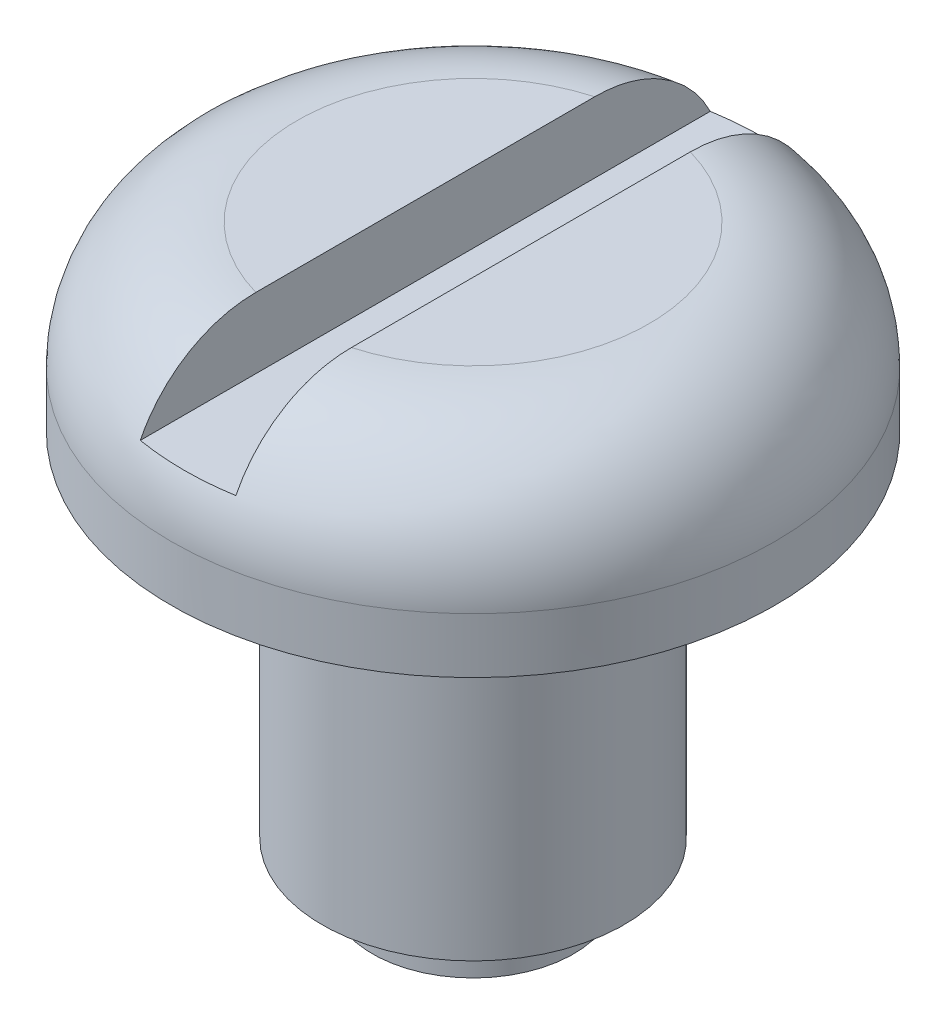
from build123d import *

# Parameters (mm, degrees)
FILLET1_R          = 2.5
SKETCH2_W          = 1.9
SKETCH2_H          = 13.430803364
CUT_EXTRUDE1_DEPTH = 1.4


with BuildPart() as part:
    # Sketch1 → Revolve1 (revolve)
    with BuildSketch(Plane.XY, mode=Mode.PRIVATE) as revolve1_sk:
        Polygon((0, 0), (2, 0), (2, 1), (3, 1), (3, 8), (6, 8), (6, 11.6), (0, 11.6), align=None)
    revolve(revolve1_sk.sketch.rotate(Axis((0, 0, 0), (0, 1, 0)), 90), axis=Axis((0, 0, 0), (0, 1, 0)))

    # Fillet1
    fillet1_edges = [part.edges().sort_by_distance(p)[0] for p in [
        (0, 11.6, 6),
    ]]
    fillet(fillet1_edges, radius=FILLET1_R)

    # Sketch2 → Cut-Extrude1 (cut)
    with BuildSketch(Plane(origin=(0, 11.6, 0), x_dir=(1, 0, 0), z_dir=(0, 1, 0))):
        Rectangle(SKETCH2_W, SKETCH2_H)
    extrude(amount=-CUT_EXTRUDE1_DEPTH, mode=Mode.SUBTRACT)


solid = part.part
